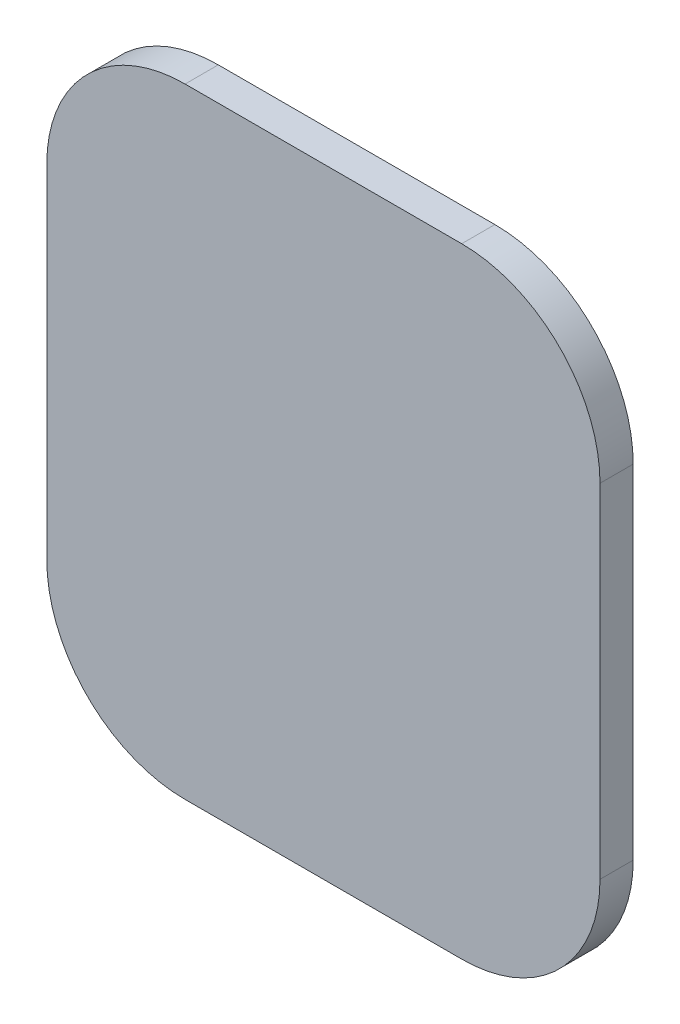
ISO-10303-21;
HEADER;
FILE_DESCRIPTION(('STEP AP214'),'2;1');
FILE_NAME('part.step','',(''),(''),'','','');
FILE_SCHEMA(('AUTOMOTIVE_DESIGN { 1 0 10303 214 1 1 1 1 }'));
ENDSEC;
DATA;
#1=APPLICATION_CONTEXT('core data for automotive mechanical design processes');
#2=APPLICATION_PROTOCOL_DEFINITION('international standard','automotive_design',2000,#1);
#3=PRODUCT_CONTEXT('',#1,'mechanical');
#4=PRODUCT('Part','Part','',(#3));
#5=PRODUCT_RELATED_PRODUCT_CATEGORY('part','',(#4));
#6=PRODUCT_DEFINITION_FORMATION('','',#4);
#7=PRODUCT_DEFINITION_CONTEXT('part definition',#1,'design');
#8=PRODUCT_DEFINITION('design','',#6,#7);
#9=PRODUCT_DEFINITION_SHAPE('','',#8);
#10=(LENGTH_UNIT() NAMED_UNIT(*) SI_UNIT(.MILLI.,.METRE.));
#11=(NAMED_UNIT(*) PLANE_ANGLE_UNIT() SI_UNIT($,.RADIAN.));
#12=(NAMED_UNIT(*) SI_UNIT($,.STERADIAN.) SOLID_ANGLE_UNIT());
#13=UNCERTAINTY_MEASURE_WITH_UNIT(LENGTH_MEASURE(1.E-05),#10,'distance_accuracy_value','');
#14=(GEOMETRIC_REPRESENTATION_CONTEXT(3) GLOBAL_UNCERTAINTY_ASSIGNED_CONTEXT((#13)) GLOBAL_UNIT_ASSIGNED_CONTEXT((#10,
#11,#12)) REPRESENTATION_CONTEXT('',''));
#15=CARTESIAN_POINT('',(0.,0.,0.));
#16=DIRECTION('',(0.,0.,1.));
#17=DIRECTION('',(1.,0.,0.));
#18=AXIS2_PLACEMENT_3D('',#15,#16,#17);
#19=CARTESIAN_POINT('',(-0.635,-0.7112,0.));
#20=DIRECTION('',(0.,0.,1.));
#21=DIRECTION('',(1.,0.,0.));
#22=AXIS2_PLACEMENT_3D('',#19,#20,#21);
#23=PLANE('',#22);
#24=CARTESIAN_POINT('',(0.3175,-0.3937,0.));
#25=DIRECTION('',(0.,0.,1.));
#26=DIRECTION('',(1.,0.,0.));
#27=AXIS2_PLACEMENT_3D('',#24,#25,#26);
#28=CIRCLE('',#27,0.3175);
#29=CARTESIAN_POINT('',(0.31749975,-0.7112,0.));
#30=VERTEX_POINT('',#29);
#31=CARTESIAN_POINT('',(0.635,-0.39369975,0.));
#32=VERTEX_POINT('',#31);
#33=EDGE_CURVE('E149',#30,#32,#28,.T.);
#34=ORIENTED_EDGE('',*,*,#33,.F.);
#35=CARTESIAN_POINT('',(-0.3175,-0.7112,0.));
#36=CARTESIAN_POINT('',(0.3175,-0.7112,0.));
#37=B_SPLINE_CURVE_WITH_KNOTS('',1,(#35,#36),.UNSPECIFIED.,.F.,.F.,(2,2),(0.,1.),.UNSPECIFIED.);
#38=CARTESIAN_POINT('',(-0.31749975,-0.7112,0.));
#39=VERTEX_POINT('',#38);
#40=EDGE_CURVE('E107',#39,#30,#37,.T.);
#41=ORIENTED_EDGE('',*,*,#40,.F.);
#42=CARTESIAN_POINT('',(-0.3175,-0.3937,0.));
#43=DIRECTION('',(0.,0.,1.));
#44=DIRECTION('',(1.,0.,0.));
#45=AXIS2_PLACEMENT_3D('',#42,#43,#44);
#46=CIRCLE('',#45,0.3175);
#47=CARTESIAN_POINT('',(-0.635,-0.39369975,0.));
#48=VERTEX_POINT('',#47);
#49=EDGE_CURVE('E151',#48,#39,#46,.T.);
#50=ORIENTED_EDGE('',*,*,#49,.F.);
#51=CARTESIAN_POINT('',(-0.635,0.3937,0.));
#52=CARTESIAN_POINT('',(-0.635,-0.3937,0.));
#53=B_SPLINE_CURVE_WITH_KNOTS('',1,(#51,#52),.UNSPECIFIED.,.F.,.F.,(2,2),(0.,1.),.UNSPECIFIED.);
#54=CARTESIAN_POINT('',(-0.635,0.39369975,0.));
#55=VERTEX_POINT('',#54);
#56=EDGE_CURVE('E117',#55,#48,#53,.T.);
#57=ORIENTED_EDGE('',*,*,#56,.F.);
#58=CARTESIAN_POINT('',(-0.3175,0.3937,0.));
#59=DIRECTION('',(0.,0.,1.));
#60=DIRECTION('',(1.,0.,0.));
#61=AXIS2_PLACEMENT_3D('',#58,#59,#60);
#62=CIRCLE('',#61,0.3175);
#63=CARTESIAN_POINT('',(-0.31749975,0.7112,0.));
#64=VERTEX_POINT('',#63);
#65=EDGE_CURVE('E153',#64,#55,#62,.T.);
#66=ORIENTED_EDGE('',*,*,#65,.F.);
#67=CARTESIAN_POINT('',(0.3175,0.7112,0.));
#68=CARTESIAN_POINT('',(-0.3175,0.7112,0.));
#69=B_SPLINE_CURVE_WITH_KNOTS('',1,(#67,#68),.UNSPECIFIED.,.F.,.F.,(2,2),(0.,1.),.UNSPECIFIED.);
#70=CARTESIAN_POINT('',(0.31749975,0.7112,0.));
#71=VERTEX_POINT('',#70);
#72=EDGE_CURVE('E85',#71,#64,#69,.T.);
#73=ORIENTED_EDGE('',*,*,#72,.F.);
#74=CARTESIAN_POINT('',(0.3175,0.3937,0.));
#75=DIRECTION('',(0.,0.,1.));
#76=DIRECTION('',(1.,0.,0.));
#77=AXIS2_PLACEMENT_3D('',#74,#75,#76);
#78=CIRCLE('',#77,0.3175);
#79=CARTESIAN_POINT('',(0.635,0.3937,2.49999999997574E-07));
#80=VERTEX_POINT('',#79);
#81=EDGE_CURVE('E21',#80,#71,#78,.T.);
#82=ORIENTED_EDGE('',*,*,#81,.F.);
#83=CARTESIAN_POINT('',(0.635,-0.3937,0.));
#84=CARTESIAN_POINT('',(0.635,0.3937,0.));
#85=B_SPLINE_CURVE_WITH_KNOTS('',1,(#83,#84),.UNSPECIFIED.,.F.,.F.,(2,2),(0.,1.),.UNSPECIFIED.);
#86=EDGE_CURVE('E83',#32,#80,#85,.T.);
#87=ORIENTED_EDGE('',*,*,#86,.F.);
#88=EDGE_LOOP('',(#34,#41,#50,#57,#66,#73,#82,#87));
#89=FACE_BOUND('',#88,.T.);
#90=ADVANCED_FACE('F17',(#89),#23,.F.);
#91=CARTESIAN_POINT('',(0.635,0.3937,0.0762));
#92=CARTESIAN_POINT('',(0.635,0.3937,0.));
#93=B_SPLINE_CURVE_WITH_KNOTS('',1,(#91,#92),.UNSPECIFIED.,.F.,.F.,(2,2),(0.,1.),.UNSPECIFIED.);
#94=CARTESIAN_POINT('',(0.3175,0.3937,0.));
#95=DIRECTION('',(0.,0.,1.));
#96=AXIS1_PLACEMENT('',#94,#95);
#97=SURFACE_OF_REVOLUTION('',#93,#96);
#98=CARTESIAN_POINT('',(0.635,0.3937,0.0762));
#99=CARTESIAN_POINT('',(0.635,0.3937,0.));
#100=B_SPLINE_CURVE_WITH_KNOTS('',1,(#98,#99),.UNSPECIFIED.,.F.,.F.,(2,2),(0.,1.),.UNSPECIFIED.);
#101=CARTESIAN_POINT('',(0.635,0.3937,0.0762));
#102=VERTEX_POINT('',#101);
#103=EDGE_CURVE('E89',#80,#102,#100,.F.);
#104=ORIENTED_EDGE('',*,*,#103,.F.);
#105=ORIENTED_EDGE('',*,*,#81,.T.);
#106=CARTESIAN_POINT('',(0.3175,0.7112,0.0762));
#107=CARTESIAN_POINT('',(0.3175,0.7112,0.));
#108=B_SPLINE_CURVE_WITH_KNOTS('',1,(#106,#107),.UNSPECIFIED.,.F.,.F.,(2,2),(0.,1.),.UNSPECIFIED.);
#109=CARTESIAN_POINT('',(0.3175,0.7112,0.0762));
#110=VERTEX_POINT('',#109);
#111=EDGE_CURVE('E133',#110,#71,#108,.T.);
#112=ORIENTED_EDGE('',*,*,#111,.F.);
#113=CARTESIAN_POINT('',(0.3175,0.3937,0.0762));
#114=DIRECTION('',(0.,0.,1.));
#115=DIRECTION('',(1.,0.,0.));
#116=AXIS2_PLACEMENT_3D('',#113,#114,#115);
#117=CIRCLE('',#116,0.3175);
#118=EDGE_CURVE('E92',#102,#110,#117,.T.);
#119=ORIENTED_EDGE('',*,*,#118,.F.);
#120=EDGE_LOOP('',(#104,#105,#112,#119));
#121=FACE_BOUND('',#120,.T.);
#122=ADVANCED_FACE('F90',(#121),#97,.F.);
#123=CARTESIAN_POINT('',(0.3175,0.7112,0.0762));
#124=DIRECTION('',(0.,1.,0.));
#125=DIRECTION('',(0.,0.,-1.));
#126=AXIS2_PLACEMENT_3D('',#123,#124,#125);
#127=PLANE('',#126);
#128=ORIENTED_EDGE('',*,*,#111,.T.);
#129=ORIENTED_EDGE('',*,*,#72,.T.);
#130=CARTESIAN_POINT('',(-0.3175,0.7112,0.0762));
#131=CARTESIAN_POINT('',(-0.3175,0.7112,0.));
#132=B_SPLINE_CURVE_WITH_KNOTS('',1,(#130,#131),.UNSPECIFIED.,.F.,.F.,(2,2),(0.,1.),.UNSPECIFIED.);
#133=CARTESIAN_POINT('',(-0.3175,0.7112,0.0762));
#134=VERTEX_POINT('',#133);
#135=EDGE_CURVE('E126',#134,#64,#132,.T.);
#136=ORIENTED_EDGE('',*,*,#135,.F.);
#137=DIRECTION('',(-1.,0.,0.));
#138=VECTOR('',#137,1.);
#139=CARTESIAN_POINT('',(0.,0.7112,0.0762));
#140=LINE('',#139,#138);
#141=EDGE_CURVE('E147',#110,#134,#140,.T.);
#142=ORIENTED_EDGE('',*,*,#141,.F.);
#143=EDGE_LOOP('',(#128,#129,#136,#142));
#144=FACE_BOUND('',#143,.T.);
#145=ADVANCED_FACE('F188',(#144),#127,.T.);
#146=CARTESIAN_POINT('',(-0.3175,0.7112,0.0762));
#147=CARTESIAN_POINT('',(-0.3175,0.7112,0.));
#148=B_SPLINE_CURVE_WITH_KNOTS('',1,(#146,#147),.UNSPECIFIED.,.F.,.F.,(2,2),(0.,1.),.UNSPECIFIED.);
#149=CARTESIAN_POINT('',(-0.3175,0.3937,0.));
#150=DIRECTION('',(0.,0.,1.));
#151=AXIS1_PLACEMENT('',#149,#150);
#152=SURFACE_OF_REVOLUTION('',#148,#151);
#153=ORIENTED_EDGE('',*,*,#135,.T.);
#154=ORIENTED_EDGE('',*,*,#65,.T.);
#155=CARTESIAN_POINT('',(-0.635,0.3937,0.0762));
#156=CARTESIAN_POINT('',(-0.635,0.3937,0.));
#157=B_SPLINE_CURVE_WITH_KNOTS('',1,(#155,#156),.UNSPECIFIED.,.F.,.F.,(2,2),(0.,1.),.UNSPECIFIED.);
#158=CARTESIAN_POINT('',(-0.635,0.3937,0.0762));
#159=VERTEX_POINT('',#158);
#160=EDGE_CURVE('E125',#159,#55,#157,.T.);
#161=ORIENTED_EDGE('',*,*,#160,.F.);
#162=CARTESIAN_POINT('',(-0.3175,0.3937,0.0762));
#163=DIRECTION('',(0.,0.,1.));
#164=DIRECTION('',(1.,0.,0.));
#165=AXIS2_PLACEMENT_3D('',#162,#163,#164);
#166=CIRCLE('',#165,0.3175);
#167=EDGE_CURVE('E144',#134,#159,#166,.T.);
#168=ORIENTED_EDGE('',*,*,#167,.F.);
#169=EDGE_LOOP('',(#153,#154,#161,#168));
#170=FACE_BOUND('',#169,.T.);
#171=ADVANCED_FACE('F183',(#170),#152,.F.);
#172=CARTESIAN_POINT('',(-0.635,0.3937,0.0762));
#173=DIRECTION('',(-1.,0.,0.));
#174=DIRECTION('',(0.,0.,-1.));
#175=AXIS2_PLACEMENT_3D('',#172,#173,#174);
#176=PLANE('',#175);
#177=ORIENTED_EDGE('',*,*,#160,.T.);
#178=ORIENTED_EDGE('',*,*,#56,.T.);
#179=CARTESIAN_POINT('',(-0.635,-0.3937,0.0762));
#180=CARTESIAN_POINT('',(-0.635,-0.3937,0.));
#181=B_SPLINE_CURVE_WITH_KNOTS('',1,(#179,#180),.UNSPECIFIED.,.F.,.F.,(2,2),(0.,1.),.UNSPECIFIED.);
#182=CARTESIAN_POINT('',(-0.635,-0.3937,0.0762));
#183=VERTEX_POINT('',#182);
#184=EDGE_CURVE('E116',#183,#48,#181,.T.);
#185=ORIENTED_EDGE('',*,*,#184,.F.);
#186=DIRECTION('',(0.,-1.,0.));
#187=VECTOR('',#186,1.);
#188=CARTESIAN_POINT('',(-0.635,0.,0.0762));
#189=LINE('',#188,#187);
#190=EDGE_CURVE('E143',#159,#183,#189,.T.);
#191=ORIENTED_EDGE('',*,*,#190,.F.);
#192=EDGE_LOOP('',(#177,#178,#185,#191));
#193=FACE_BOUND('',#192,.T.);
#194=ADVANCED_FACE('F187',(#193),#176,.T.);
#195=CARTESIAN_POINT('',(-0.635,-0.3937,0.0762));
#196=CARTESIAN_POINT('',(-0.635,-0.3937,0.));
#197=B_SPLINE_CURVE_WITH_KNOTS('',1,(#195,#196),.UNSPECIFIED.,.F.,.F.,(2,2),(0.,1.),.UNSPECIFIED.);
#198=CARTESIAN_POINT('',(-0.3175,-0.3937,0.));
#199=DIRECTION('',(0.,0.,1.));
#200=AXIS1_PLACEMENT('',#198,#199);
#201=SURFACE_OF_REVOLUTION('',#197,#200);
#202=ORIENTED_EDGE('',*,*,#184,.T.);
#203=ORIENTED_EDGE('',*,*,#49,.T.);
#204=CARTESIAN_POINT('',(-0.3175,-0.7112,0.0762));
#205=CARTESIAN_POINT('',(-0.3175,-0.7112,0.));
#206=B_SPLINE_CURVE_WITH_KNOTS('',1,(#204,#205),.UNSPECIFIED.,.F.,.F.,(2,2),(0.,1.),.UNSPECIFIED.);
#207=CARTESIAN_POINT('',(-0.3175,-0.7112,0.0762));
#208=VERTEX_POINT('',#207);
#209=EDGE_CURVE('E115',#208,#39,#206,.T.);
#210=ORIENTED_EDGE('',*,*,#209,.F.);
#211=CARTESIAN_POINT('',(-0.3175,-0.3937,0.0762));
#212=DIRECTION('',(0.,0.,1.));
#213=DIRECTION('',(1.,0.,0.));
#214=AXIS2_PLACEMENT_3D('',#211,#212,#213);
#215=CIRCLE('',#214,0.3175);
#216=EDGE_CURVE('E140',#183,#208,#215,.T.);
#217=ORIENTED_EDGE('',*,*,#216,.F.);
#218=EDGE_LOOP('',(#202,#203,#210,#217));
#219=FACE_BOUND('',#218,.T.);
#220=ADVANCED_FACE('F189',(#219),#201,.F.);
#221=CARTESIAN_POINT('',(-0.3175,-0.7112,0.0762));
#222=DIRECTION('',(0.,-1.,0.));
#223=DIRECTION('',(0.,0.,-1.));
#224=AXIS2_PLACEMENT_3D('',#221,#222,#223);
#225=PLANE('',#224);
#226=ORIENTED_EDGE('',*,*,#209,.T.);
#227=ORIENTED_EDGE('',*,*,#40,.T.);
#228=CARTESIAN_POINT('',(0.3175,-0.7112,0.0762));
#229=CARTESIAN_POINT('',(0.3175,-0.7112,0.));
#230=B_SPLINE_CURVE_WITH_KNOTS('',1,(#228,#229),.UNSPECIFIED.,.F.,.F.,(2,2),(0.,1.),.UNSPECIFIED.);
#231=CARTESIAN_POINT('',(0.3175,-0.7112,0.0762));
#232=VERTEX_POINT('',#231);
#233=EDGE_CURVE('E94',#232,#30,#230,.T.);
#234=ORIENTED_EDGE('',*,*,#233,.F.);
#235=DIRECTION('',(1.,0.,0.));
#236=VECTOR('',#235,1.);
#237=CARTESIAN_POINT('',(0.,-0.7112,0.0762));
#238=LINE('',#237,#236);
#239=EDGE_CURVE('E139',#208,#232,#238,.T.);
#240=ORIENTED_EDGE('',*,*,#239,.F.);
#241=EDGE_LOOP('',(#226,#227,#234,#240));
#242=FACE_BOUND('',#241,.T.);
#243=ADVANCED_FACE('F201',(#242),#225,.T.);
#244=CARTESIAN_POINT('',(0.3175,-0.7112,0.0762));
#245=CARTESIAN_POINT('',(0.3175,-0.7112,0.));
#246=B_SPLINE_CURVE_WITH_KNOTS('',1,(#244,#245),.UNSPECIFIED.,.F.,.F.,(2,2),(0.,1.),.UNSPECIFIED.);
#247=CARTESIAN_POINT('',(0.3175,-0.3937,0.));
#248=DIRECTION('',(0.,0.,1.));
#249=AXIS1_PLACEMENT('',#247,#248);
#250=SURFACE_OF_REVOLUTION('',#246,#249);
#251=ORIENTED_EDGE('',*,*,#233,.T.);
#252=ORIENTED_EDGE('',*,*,#33,.T.);
#253=CARTESIAN_POINT('',(0.635,-0.3937,0.0762));
#254=CARTESIAN_POINT('',(0.635,-0.3937,0.));
#255=B_SPLINE_CURVE_WITH_KNOTS('',1,(#253,#254),.UNSPECIFIED.,.F.,.F.,(2,2),(0.,1.),.UNSPECIFIED.);
#256=CARTESIAN_POINT('',(0.635,-0.3937,0.0762));
#257=VERTEX_POINT('',#256);
#258=EDGE_CURVE('E36',#257,#32,#255,.T.);
#259=ORIENTED_EDGE('',*,*,#258,.F.);
#260=CARTESIAN_POINT('',(0.3175,-0.3937,0.0762));
#261=DIRECTION('',(0.,0.,1.));
#262=DIRECTION('',(1.,0.,0.));
#263=AXIS2_PLACEMENT_3D('',#260,#261,#262);
#264=CIRCLE('',#263,0.3175);
#265=EDGE_CURVE('E27',#232,#257,#264,.T.);
#266=ORIENTED_EDGE('',*,*,#265,.F.);
#267=EDGE_LOOP('',(#251,#252,#259,#266));
#268=FACE_BOUND('',#267,.T.);
#269=ADVANCED_FACE('F203',(#268),#250,.F.);
#270=CARTESIAN_POINT('',(0.635,-0.3937,0.0762));
#271=DIRECTION('',(1.,0.,0.));
#272=DIRECTION('',(0.,0.,-1.));
#273=AXIS2_PLACEMENT_3D('',#270,#271,#272);
#274=PLANE('',#273);
#275=ORIENTED_EDGE('',*,*,#258,.T.);
#276=ORIENTED_EDGE('',*,*,#86,.T.);
#277=ORIENTED_EDGE('',*,*,#103,.T.);
#278=DIRECTION('',(0.,1.,0.));
#279=VECTOR('',#278,1.);
#280=CARTESIAN_POINT('',(0.635,0.,0.0762));
#281=LINE('',#280,#279);
#282=EDGE_CURVE('E11',#257,#102,#281,.T.);
#283=ORIENTED_EDGE('',*,*,#282,.F.);
#284=EDGE_LOOP('',(#275,#276,#277,#283));
#285=FACE_BOUND('',#284,.T.);
#286=ADVANCED_FACE('F96',(#285),#274,.T.);
#287=CARTESIAN_POINT('',(-0.635,-0.7112,0.0762));
#288=DIRECTION('',(0.,0.,1.));
#289=DIRECTION('',(1.,0.,0.));
#290=AXIS2_PLACEMENT_3D('',#287,#288,#289);
#291=PLANE('',#290);
#292=ORIENTED_EDGE('',*,*,#265,.T.);
#293=ORIENTED_EDGE('',*,*,#282,.T.);
#294=ORIENTED_EDGE('',*,*,#118,.T.);
#295=ORIENTED_EDGE('',*,*,#141,.T.);
#296=ORIENTED_EDGE('',*,*,#167,.T.);
#297=ORIENTED_EDGE('',*,*,#190,.T.);
#298=ORIENTED_EDGE('',*,*,#216,.T.);
#299=ORIENTED_EDGE('',*,*,#239,.T.);
#300=EDGE_LOOP('',(#292,#293,#294,#295,#296,#297,#298,#299));
#301=FACE_BOUND('',#300,.T.);
#302=ADVANCED_FACE('F19',(#301),#291,.T.);
#303=CLOSED_SHELL('',(#90,#122,#145,#171,#194,#220,#243,#269,#286,#302));
#304=MANIFOLD_SOLID_BREP('B1',#303);
#305=ADVANCED_BREP_SHAPE_REPRESENTATION('',(#18,#304),#14);
#306=SHAPE_DEFINITION_REPRESENTATION(#9,#305);
ENDSEC;
END-ISO-10303-21;
